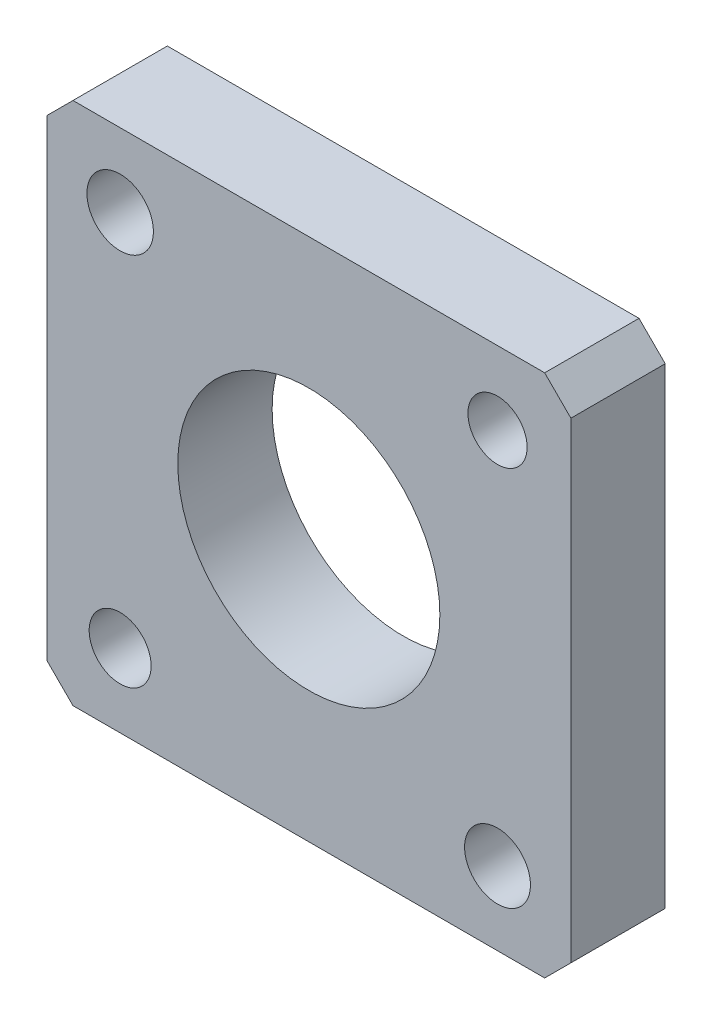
ISO-10303-21;
HEADER;
FILE_DESCRIPTION(('STEP AP214'),'2;1');
FILE_NAME('part.step','',(''),(''),'','','');
FILE_SCHEMA(('AUTOMOTIVE_DESIGN { 1 0 10303 214 1 1 1 1 }'));
ENDSEC;
DATA;
#1=APPLICATION_CONTEXT('core data for automotive mechanical design processes');
#2=APPLICATION_PROTOCOL_DEFINITION('international standard','automotive_design',2000,#1);
#3=PRODUCT_CONTEXT('',#1,'mechanical');
#4=PRODUCT('Part','Part','',(#3));
#5=PRODUCT_RELATED_PRODUCT_CATEGORY('part','',(#4));
#6=PRODUCT_DEFINITION_FORMATION('','',#4);
#7=PRODUCT_DEFINITION_CONTEXT('part definition',#1,'design');
#8=PRODUCT_DEFINITION('design','',#6,#7);
#9=PRODUCT_DEFINITION_SHAPE('','',#8);
#10=(LENGTH_UNIT() NAMED_UNIT(*) SI_UNIT(.MILLI.,.METRE.));
#11=(NAMED_UNIT(*) PLANE_ANGLE_UNIT() SI_UNIT($,.RADIAN.));
#12=(NAMED_UNIT(*) SI_UNIT($,.STERADIAN.) SOLID_ANGLE_UNIT());
#13=UNCERTAINTY_MEASURE_WITH_UNIT(LENGTH_MEASURE(1.E-05),#10,'distance_accuracy_value','');
#14=(GEOMETRIC_REPRESENTATION_CONTEXT(3) GLOBAL_UNCERTAINTY_ASSIGNED_CONTEXT((#13)) GLOBAL_UNIT_ASSIGNED_CONTEXT((#10,
#11,#12)) REPRESENTATION_CONTEXT('',''));
#15=CARTESIAN_POINT('',(0.,0.,0.));
#16=DIRECTION('',(0.,0.,1.));
#17=DIRECTION('',(1.,0.,0.));
#18=AXIS2_PLACEMENT_3D('',#15,#16,#17);
#19=CARTESIAN_POINT('',(-90.1207756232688,73.2624653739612,18.));
#20=DIRECTION('',(1.,0.,0.));
#21=DIRECTION('',(0.,1.,0.));
#22=AXIS2_PLACEMENT_3D('',#19,#20,#21);
#23=PLANE('',#22);
#24=DIRECTION('',(0.,-1.,0.));
#25=VECTOR('',#24,1.);
#26=CARTESIAN_POINT('',(-90.1207756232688,73.2624653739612,18.));
#27=LINE('',#26,#25);
#28=CARTESIAN_POINT('',(-90.1207756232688,68.2624653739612,18.));
#29=VERTEX_POINT('',#28);
#30=CARTESIAN_POINT('',(-90.1207756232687,-21.7375346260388,17.9999999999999));
#31=VERTEX_POINT('',#30);
#32=EDGE_CURVE('E120',#29,#31,#27,.T.);
#33=ORIENTED_EDGE('',*,*,#32,.F.);
#34=DIRECTION('',(0.,0.,-1.));
#35=VECTOR('',#34,1.);
#36=CARTESIAN_POINT('',(-90.1207756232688,68.2624653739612,18.));
#37=LINE('',#36,#35);
#38=CARTESIAN_POINT('',(-90.1207756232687,68.2624653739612,0.));
#39=VERTEX_POINT('',#38);
#40=EDGE_CURVE('E105',#29,#39,#37,.T.);
#41=ORIENTED_EDGE('',*,*,#40,.T.);
#42=DIRECTION('',(0.,-1.,0.));
#43=VECTOR('',#42,1.);
#44=CARTESIAN_POINT('',(-90.1207756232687,73.2624653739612,0.));
#45=LINE('',#44,#43);
#46=CARTESIAN_POINT('',(-90.1207756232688,-21.7375346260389,0.));
#47=VERTEX_POINT('',#46);
#48=EDGE_CURVE('E117',#39,#47,#45,.T.);
#49=ORIENTED_EDGE('',*,*,#48,.T.);
#50=DIRECTION('',(0.,0.,1.));
#51=VECTOR('',#50,1.);
#52=CARTESIAN_POINT('',(-90.1207756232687,-21.7375346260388,17.9999999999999));
#53=LINE('',#52,#51);
#54=EDGE_CURVE('E122',#47,#31,#53,.T.);
#55=ORIENTED_EDGE('',*,*,#54,.T.);
#56=EDGE_LOOP('',(#33,#41,#49,#55));
#57=FACE_BOUND('',#56,.T.);
#58=ADVANCED_FACE('F36',(#57),#23,.F.);
#59=CARTESIAN_POINT('',(-90.1207756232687,-26.7375346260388,17.9999999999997));
#60=DIRECTION('',(0.,1.,0.));
#61=DIRECTION('',(0.,0.,1.));
#62=AXIS2_PLACEMENT_3D('',#59,#60,#61);
#63=PLANE('',#62);
#64=DIRECTION('',(1.,0.,0.));
#65=VECTOR('',#64,1.);
#66=CARTESIAN_POINT('',(-90.1207756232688,-26.737534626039,-3.33066907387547E-13));
#67=LINE('',#66,#65);
#68=CARTESIAN_POINT('',(-85.1207756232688,-26.7375346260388,-1.11022302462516E-13));
#69=VERTEX_POINT('',#68);
#70=CARTESIAN_POINT('',(4.87922437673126,-26.7375346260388,-3.33066907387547E-13));
#71=VERTEX_POINT('',#70);
#72=EDGE_CURVE('E126',#69,#71,#67,.T.);
#73=ORIENTED_EDGE('',*,*,#72,.T.);
#74=DIRECTION('',(0.,0.,1.));
#75=VECTOR('',#74,1.);
#76=CARTESIAN_POINT('',(4.87922437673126,-26.7375346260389,17.9999999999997));
#77=LINE('',#76,#75);
#78=CARTESIAN_POINT('',(4.87922437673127,-26.7375346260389,17.9999999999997));
#79=VERTEX_POINT('',#78);
#80=EDGE_CURVE('E13',#71,#79,#77,.T.);
#81=ORIENTED_EDGE('',*,*,#80,.T.);
#82=DIRECTION('',(1.,0.,0.));
#83=VECTOR('',#82,1.);
#84=CARTESIAN_POINT('',(-90.1207756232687,-26.7375346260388,17.9999999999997));
#85=LINE('',#84,#83);
#86=CARTESIAN_POINT('',(-85.1207756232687,-26.7375346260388,17.9999999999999));
#87=VERTEX_POINT('',#86);
#88=EDGE_CURVE('E141',#87,#79,#85,.T.);
#89=ORIENTED_EDGE('',*,*,#88,.F.);
#90=DIRECTION('',(0.,0.,-1.));
#91=VECTOR('',#90,1.);
#92=CARTESIAN_POINT('',(-85.1207756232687,-26.7375346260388,17.9999999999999));
#93=LINE('',#92,#91);
#94=EDGE_CURVE('E43',#87,#69,#93,.T.);
#95=ORIENTED_EDGE('',*,*,#94,.T.);
#96=EDGE_LOOP('',(#73,#81,#89,#95));
#97=FACE_BOUND('',#96,.T.);
#98=ADVANCED_FACE('F170',(#97),#63,.F.);
#99=CARTESIAN_POINT('',(9.87922437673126,73.2624653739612,17.9999999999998));
#100=DIRECTION('',(-1.,0.,0.));
#101=DIRECTION('',(0.,-1.,0.));
#102=AXIS2_PLACEMENT_3D('',#99,#100,#101);
#103=PLANE('',#102);
#104=DIRECTION('',(0.,1.,0.));
#105=VECTOR('',#104,1.);
#106=CARTESIAN_POINT('',(9.87922437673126,73.2624653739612,-2.22044604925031E-13));
#107=LINE('',#106,#105);
#108=CARTESIAN_POINT('',(9.87922437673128,-21.7375346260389,0.));
#109=VERTEX_POINT('',#108);
#110=CARTESIAN_POINT('',(9.87922437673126,68.2624653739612,0.));
#111=VERTEX_POINT('',#110);
#112=EDGE_CURVE('E130',#109,#111,#107,.T.);
#113=ORIENTED_EDGE('',*,*,#112,.T.);
#114=DIRECTION('',(0.,0.,1.));
#115=VECTOR('',#114,1.);
#116=CARTESIAN_POINT('',(9.87922437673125,68.2624653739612,18.));
#117=LINE('',#116,#115);
#118=CARTESIAN_POINT('',(9.87922437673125,68.2624653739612,18.));
#119=VERTEX_POINT('',#118);
#120=EDGE_CURVE('E50',#111,#119,#117,.T.);
#121=ORIENTED_EDGE('',*,*,#120,.T.);
#122=DIRECTION('',(0.,1.,0.));
#123=VECTOR('',#122,1.);
#124=CARTESIAN_POINT('',(9.87922437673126,73.2624653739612,17.9999999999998));
#125=LINE('',#124,#123);
#126=CARTESIAN_POINT('',(9.87922437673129,-21.7375346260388,18.));
#127=VERTEX_POINT('',#126);
#128=EDGE_CURVE('E143',#127,#119,#125,.T.);
#129=ORIENTED_EDGE('',*,*,#128,.F.);
#130=DIRECTION('',(0.,0.,-1.));
#131=VECTOR('',#130,1.);
#132=CARTESIAN_POINT('',(9.87922437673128,-21.7375346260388,18.));
#133=LINE('',#132,#131);
#134=EDGE_CURVE('E163',#127,#109,#133,.T.);
#135=ORIENTED_EDGE('',*,*,#134,.T.);
#136=EDGE_LOOP('',(#113,#121,#129,#135));
#137=FACE_BOUND('',#136,.T.);
#138=ADVANCED_FACE('F178',(#137),#103,.F.);
#139=CARTESIAN_POINT('',(-90.1207756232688,73.2624653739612,18.));
#140=DIRECTION('',(0.,-1.,0.));
#141=DIRECTION('',(0.,0.,-1.));
#142=AXIS2_PLACEMENT_3D('',#139,#140,#141);
#143=PLANE('',#142);
#144=DIRECTION('',(-1.,0.,0.));
#145=VECTOR('',#144,1.);
#146=CARTESIAN_POINT('',(-90.1207756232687,73.2624653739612,0.));
#147=LINE('',#146,#145);
#148=CARTESIAN_POINT('',(4.87922437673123,73.2624653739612,0.));
#149=VERTEX_POINT('',#148);
#150=CARTESIAN_POINT('',(-85.1207756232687,73.2624653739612,-3.33066907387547E-13));
#151=VERTEX_POINT('',#150);
#152=EDGE_CURVE('E138',#149,#151,#147,.T.);
#153=ORIENTED_EDGE('',*,*,#152,.T.);
#154=DIRECTION('',(0.,0.,1.));
#155=VECTOR('',#154,1.);
#156=CARTESIAN_POINT('',(-85.1207756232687,73.2624653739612,17.9999999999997));
#157=LINE('',#156,#155);
#158=CARTESIAN_POINT('',(-85.1207756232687,73.2624653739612,17.9999999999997));
#159=VERTEX_POINT('',#158);
#160=EDGE_CURVE('E106',#151,#159,#157,.T.);
#161=ORIENTED_EDGE('',*,*,#160,.T.);
#162=DIRECTION('',(-1.,0.,0.));
#163=VECTOR('',#162,1.);
#164=CARTESIAN_POINT('',(-90.1207756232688,73.2624653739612,18.));
#165=LINE('',#164,#163);
#166=CARTESIAN_POINT('',(4.87922437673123,73.2624653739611,18.));
#167=VERTEX_POINT('',#166);
#168=EDGE_CURVE('E145',#167,#159,#165,.T.);
#169=ORIENTED_EDGE('',*,*,#168,.F.);
#170=DIRECTION('',(0.,0.,-1.));
#171=VECTOR('',#170,1.);
#172=CARTESIAN_POINT('',(4.87922437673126,73.2624653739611,18.));
#173=LINE('',#172,#171);
#174=EDGE_CURVE('E111',#167,#149,#173,.T.);
#175=ORIENTED_EDGE('',*,*,#174,.T.);
#176=EDGE_LOOP('',(#153,#161,#169,#175));
#177=FACE_BOUND('',#176,.T.);
#178=ADVANCED_FACE('F186',(#177),#143,.F.);
#179=CARTESIAN_POINT('',(-90.1207756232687,-26.7375346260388,17.9999999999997));
#180=DIRECTION('',(0.,0.,1.));
#181=DIRECTION('',(1.,0.,0.));
#182=AXIS2_PLACEMENT_3D('',#179,#180,#181);
#183=PLANE('',#182);
#184=CARTESIAN_POINT('',(-4.12077562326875,-12.7375346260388,18.));
#185=DIRECTION('',(0.,0.,1.));
#186=DIRECTION('',(1.,0.,0.));
#187=AXIS2_PLACEMENT_3D('',#184,#185,#186);
#188=CIRCLE('',#187,6.2848154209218);
#189=CARTESIAN_POINT('',(2.16403979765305,-12.7375346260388,18.));
#190=VERTEX_POINT('',#189);
#191=EDGE_CURVE('E254',#190,#190,#188,.T.);
#192=ORIENTED_EDGE('',*,*,#191,.F.);
#193=EDGE_LOOP('',(#192));
#194=FACE_BOUND('',#193,.T.);
#195=CARTESIAN_POINT('',(-76.1207756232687,-12.7375346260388,18.));
#196=DIRECTION('',(0.,0.,1.));
#197=DIRECTION('',(1.,0.,0.));
#198=AXIS2_PLACEMENT_3D('',#195,#196,#197);
#199=CIRCLE('',#198,5.9095106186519);
#200=CARTESIAN_POINT('',(-70.2112650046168,-12.7375346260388,18.));
#201=VERTEX_POINT('',#200);
#202=EDGE_CURVE('E256',#201,#201,#199,.T.);
#203=ORIENTED_EDGE('',*,*,#202,.F.);
#204=EDGE_LOOP('',(#203));
#205=FACE_BOUND('',#204,.T.);
#206=CARTESIAN_POINT('',(-76.1207756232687,59.2624653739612,18.));
#207=DIRECTION('',(0.,0.,1.));
#208=DIRECTION('',(1.,0.,0.));
#209=AXIS2_PLACEMENT_3D('',#206,#207,#208);
#210=CIRCLE('',#209,6.34412869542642);
#211=CARTESIAN_POINT('',(-69.7766469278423,59.2624653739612,18.));
#212=VERTEX_POINT('',#211);
#213=EDGE_CURVE('E264',#212,#212,#210,.T.);
#214=ORIENTED_EDGE('',*,*,#213,.F.);
#215=EDGE_LOOP('',(#214));
#216=FACE_BOUND('',#215,.T.);
#217=CARTESIAN_POINT('',(-4.12077562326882,59.2624653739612,18.));
#218=DIRECTION('',(0.,0.,1.));
#219=DIRECTION('',(1.,0.,0.));
#220=AXIS2_PLACEMENT_3D('',#217,#218,#219);
#221=CIRCLE('',#220,5.64830073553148);
#222=CARTESIAN_POINT('',(1.52752511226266,59.2624653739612,18.));
#223=VERTEX_POINT('',#222);
#224=EDGE_CURVE('E270',#223,#223,#221,.T.);
#225=ORIENTED_EDGE('',*,*,#224,.F.);
#226=EDGE_LOOP('',(#225));
#227=FACE_BOUND('',#226,.T.);
#228=CARTESIAN_POINT('',(-40.1207756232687,23.2624653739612,17.9999999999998));
#229=DIRECTION('',(0.,0.,1.));
#230=DIRECTION('',(1.,0.,0.));
#231=AXIS2_PLACEMENT_3D('',#228,#229,#230);
#232=CIRCLE('',#231,25.);
#233=CARTESIAN_POINT('',(-15.1207756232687,23.2624653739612,17.9999999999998));
#234=VERTEX_POINT('',#233);
#235=EDGE_CURVE('E133',#234,#234,#232,.T.);
#236=ORIENTED_EDGE('',*,*,#235,.F.);
#237=EDGE_LOOP('',(#236));
#238=FACE_BOUND('',#237,.T.);
#239=ORIENTED_EDGE('',*,*,#168,.T.);
#240=DIRECTION('',(0.707106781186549,0.707106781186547,0.));
#241=VECTOR('',#240,1.);
#242=CARTESIAN_POINT('',(-137.620775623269,20.7624653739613,18.));
#243=LINE('',#242,#241);
#244=EDGE_CURVE('E161',#159,#29,#243,.F.);
#245=ORIENTED_EDGE('',*,*,#244,.T.);
#246=ORIENTED_EDGE('',*,*,#32,.T.);
#247=DIRECTION('',(-0.707106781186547,0.707106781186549,0.));
#248=VECTOR('',#247,1.);
#249=CARTESIAN_POINT('',(-87.6207756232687,-24.2375346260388,17.9999999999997));
#250=LINE('',#249,#248);
#251=EDGE_CURVE('E156',#31,#87,#250,.F.);
#252=ORIENTED_EDGE('',*,*,#251,.T.);
#253=ORIENTED_EDGE('',*,*,#88,.T.);
#254=DIRECTION('',(-0.707106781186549,-0.707106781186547,0.));
#255=VECTOR('',#254,1.);
#256=CARTESIAN_POINT('',(-42.6207756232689,-74.2375346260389,18.));
#257=LINE('',#256,#255);
#258=EDGE_CURVE('E57',#79,#127,#257,.F.);
#259=ORIENTED_EDGE('',*,*,#258,.T.);
#260=ORIENTED_EDGE('',*,*,#128,.T.);
#261=DIRECTION('',(0.707106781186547,-0.707106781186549,0.));
#262=VECTOR('',#261,1.);
#263=CARTESIAN_POINT('',(7.3792243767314,70.7624653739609,17.9999999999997));
#264=LINE('',#263,#262);
#265=EDGE_CURVE('E159',#119,#167,#264,.F.);
#266=ORIENTED_EDGE('',*,*,#265,.T.);
#267=EDGE_LOOP('',(#239,#245,#246,#252,#253,#259,#260,#266));
#268=FACE_BOUND('',#267,.T.);
#269=ADVANCED_FACE('F180',(#194,#205,#216,#227,#238,#268),#183,.T.);
#270=CARTESIAN_POINT('',(-90.1207756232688,-26.737534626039,-3.33066907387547E-13));
#271=DIRECTION('',(0.,0.,1.));
#272=DIRECTION('',(1.,0.,0.));
#273=AXIS2_PLACEMENT_3D('',#270,#271,#272);
#274=PLANE('',#273);
#275=CARTESIAN_POINT('',(-4.12077562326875,-12.7375346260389,0.));
#276=DIRECTION('',(0.,0.,1.));
#277=DIRECTION('',(1.,0.,0.));
#278=AXIS2_PLACEMENT_3D('',#275,#276,#277);
#279=CIRCLE('',#278,6.2848154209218);
#280=CARTESIAN_POINT('',(2.16403979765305,-12.7375346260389,0.));
#281=VERTEX_POINT('',#280);
#282=EDGE_CURVE('E251',#281,#281,#279,.T.);
#283=ORIENTED_EDGE('',*,*,#282,.T.);
#284=EDGE_LOOP('',(#283));
#285=FACE_BOUND('',#284,.T.);
#286=CARTESIAN_POINT('',(-76.1207756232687,-12.7375346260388,0.));
#287=DIRECTION('',(0.,0.,1.));
#288=DIRECTION('',(1.,0.,0.));
#289=AXIS2_PLACEMENT_3D('',#286,#287,#288);
#290=CIRCLE('',#289,5.9095106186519);
#291=CARTESIAN_POINT('',(-70.2112650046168,-12.7375346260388,0.));
#292=VERTEX_POINT('',#291);
#293=EDGE_CURVE('E261',#292,#292,#290,.T.);
#294=ORIENTED_EDGE('',*,*,#293,.T.);
#295=EDGE_LOOP('',(#294));
#296=FACE_BOUND('',#295,.T.);
#297=CARTESIAN_POINT('',(-76.1207756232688,59.2624653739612,0.));
#298=DIRECTION('',(0.,0.,1.));
#299=DIRECTION('',(1.,0.,0.));
#300=AXIS2_PLACEMENT_3D('',#297,#298,#299);
#301=CIRCLE('',#300,6.34412869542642);
#302=CARTESIAN_POINT('',(-69.7766469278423,59.2624653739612,0.));
#303=VERTEX_POINT('',#302);
#304=EDGE_CURVE('E267',#303,#303,#301,.T.);
#305=ORIENTED_EDGE('',*,*,#304,.T.);
#306=EDGE_LOOP('',(#305));
#307=FACE_BOUND('',#306,.T.);
#308=CARTESIAN_POINT('',(-4.12077562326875,59.2624653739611,0.));
#309=DIRECTION('',(0.,0.,1.));
#310=DIRECTION('',(1.,0.,0.));
#311=AXIS2_PLACEMENT_3D('',#308,#309,#310);
#312=CIRCLE('',#311,5.64830073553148);
#313=CARTESIAN_POINT('',(1.52752511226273,59.2624653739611,0.));
#314=VERTEX_POINT('',#313);
#315=EDGE_CURVE('E273',#314,#314,#312,.T.);
#316=ORIENTED_EDGE('',*,*,#315,.T.);
#317=EDGE_LOOP('',(#316));
#318=FACE_BOUND('',#317,.T.);
#319=CARTESIAN_POINT('',(-40.1207756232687,23.2624653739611,-2.22044604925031E-13));
#320=DIRECTION('',(0.,0.,1.));
#321=DIRECTION('',(1.,0.,0.));
#322=AXIS2_PLACEMENT_3D('',#319,#320,#321);
#323=CIRCLE('',#322,25.);
#324=CARTESIAN_POINT('',(-15.1207756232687,23.2624653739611,-2.22044604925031E-13));
#325=VERTEX_POINT('',#324);
#326=EDGE_CURVE('E127',#325,#325,#323,.T.);
#327=ORIENTED_EDGE('',*,*,#326,.T.);
#328=EDGE_LOOP('',(#327));
#329=FACE_BOUND('',#328,.T.);
#330=ORIENTED_EDGE('',*,*,#48,.F.);
#331=DIRECTION('',(-0.707106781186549,-0.707106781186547,0.));
#332=VECTOR('',#331,1.);
#333=CARTESIAN_POINT('',(-90.1207756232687,68.2624653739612,0.));
#334=LINE('',#333,#332);
#335=EDGE_CURVE('E101',#39,#151,#334,.F.);
#336=ORIENTED_EDGE('',*,*,#335,.T.);
#337=ORIENTED_EDGE('',*,*,#152,.F.);
#338=DIRECTION('',(-0.707106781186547,0.707106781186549,0.));
#339=VECTOR('',#338,1.);
#340=CARTESIAN_POINT('',(4.87922437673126,73.2624653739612,0.));
#341=LINE('',#340,#339);
#342=EDGE_CURVE('E112',#149,#111,#341,.F.);
#343=ORIENTED_EDGE('',*,*,#342,.T.);
#344=ORIENTED_EDGE('',*,*,#112,.F.);
#345=DIRECTION('',(0.707106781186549,0.707106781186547,0.));
#346=VECTOR('',#345,1.);
#347=CARTESIAN_POINT('',(9.87922437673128,-21.7375346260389,0.));
#348=LINE('',#347,#346);
#349=EDGE_CURVE('E150',#109,#71,#348,.F.);
#350=ORIENTED_EDGE('',*,*,#349,.T.);
#351=ORIENTED_EDGE('',*,*,#72,.F.);
#352=DIRECTION('',(0.707106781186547,-0.707106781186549,0.));
#353=VECTOR('',#352,1.);
#354=CARTESIAN_POINT('',(-85.1207756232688,-26.7375346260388,-1.11022302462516E-13));
#355=LINE('',#354,#353);
#356=EDGE_CURVE('E121',#69,#47,#355,.F.);
#357=ORIENTED_EDGE('',*,*,#356,.T.);
#358=EDGE_LOOP('',(#330,#336,#337,#343,#344,#350,#351,#357));
#359=FACE_BOUND('',#358,.T.);
#360=ADVANCED_FACE('F124',(#285,#296,#307,#318,#329,#359),#274,.F.);
#361=CARTESIAN_POINT('',(-90.1207756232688,68.2624653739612,18.));
#362=DIRECTION('',(0.707106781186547,-0.707106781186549,0.));
#363=DIRECTION('',(0.707106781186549,0.707106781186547,0.));
#364=AXIS2_PLACEMENT_3D('',#361,#362,#363);
#365=PLANE('',#364);
#366=ORIENTED_EDGE('',*,*,#244,.F.);
#367=ORIENTED_EDGE('',*,*,#160,.F.);
#368=ORIENTED_EDGE('',*,*,#335,.F.);
#369=ORIENTED_EDGE('',*,*,#40,.F.);
#370=EDGE_LOOP('',(#366,#367,#368,#369));
#371=FACE_BOUND('',#370,.T.);
#372=ADVANCED_FACE('F104',(#371),#365,.F.);
#373=CARTESIAN_POINT('',(4.87922437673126,73.2624653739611,18.));
#374=DIRECTION('',(-0.707106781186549,-0.707106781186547,0.));
#375=DIRECTION('',(0.707106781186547,-0.707106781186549,0.));
#376=AXIS2_PLACEMENT_3D('',#373,#374,#375);
#377=PLANE('',#376);
#378=ORIENTED_EDGE('',*,*,#265,.F.);
#379=ORIENTED_EDGE('',*,*,#120,.F.);
#380=ORIENTED_EDGE('',*,*,#342,.F.);
#381=ORIENTED_EDGE('',*,*,#174,.F.);
#382=EDGE_LOOP('',(#378,#379,#380,#381));
#383=FACE_BOUND('',#382,.T.);
#384=ADVANCED_FACE('F184',(#383),#377,.F.);
#385=CARTESIAN_POINT('',(9.87922437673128,-21.7375346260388,18.));
#386=DIRECTION('',(-0.707106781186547,0.707106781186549,0.));
#387=DIRECTION('',(-0.707106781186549,-0.707106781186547,0.));
#388=AXIS2_PLACEMENT_3D('',#385,#386,#387);
#389=PLANE('',#388);
#390=ORIENTED_EDGE('',*,*,#258,.F.);
#391=ORIENTED_EDGE('',*,*,#80,.F.);
#392=ORIENTED_EDGE('',*,*,#349,.F.);
#393=ORIENTED_EDGE('',*,*,#134,.F.);
#394=EDGE_LOOP('',(#390,#391,#392,#393));
#395=FACE_BOUND('',#394,.T.);
#396=ADVANCED_FACE('F177',(#395),#389,.F.);
#397=CARTESIAN_POINT('',(-85.1207756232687,-26.7375346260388,17.9999999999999));
#398=DIRECTION('',(0.707106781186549,0.707106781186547,0.));
#399=DIRECTION('',(-0.707106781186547,0.707106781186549,0.));
#400=AXIS2_PLACEMENT_3D('',#397,#398,#399);
#401=PLANE('',#400);
#402=ORIENTED_EDGE('',*,*,#251,.F.);
#403=ORIENTED_EDGE('',*,*,#54,.F.);
#404=ORIENTED_EDGE('',*,*,#356,.F.);
#405=ORIENTED_EDGE('',*,*,#94,.F.);
#406=EDGE_LOOP('',(#402,#403,#404,#405));
#407=FACE_BOUND('',#406,.T.);
#408=ADVANCED_FACE('F187',(#407),#401,.F.);
#409=CARTESIAN_POINT('',(-40.1207756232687,23.2624653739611,-2.22044604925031E-13));
#410=DIRECTION('',(0.,0.,1.));
#411=DIRECTION('',(1.,0.,0.));
#412=AXIS2_PLACEMENT_3D('',#409,#410,#411);
#413=CYLINDRICAL_SURFACE('',#412,25.);
#414=ORIENTED_EDGE('',*,*,#326,.F.);
#415=EDGE_LOOP('',(#414));
#416=FACE_BOUND('',#415,.T.);
#417=ORIENTED_EDGE('',*,*,#235,.T.);
#418=EDGE_LOOP('',(#417));
#419=FACE_BOUND('',#418,.T.);
#420=ADVANCED_FACE('F189',(#416,#419),#413,.F.);
#421=CARTESIAN_POINT('',(-4.12077562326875,59.2624653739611,0.));
#422=DIRECTION('',(0.,0.,1.));
#423=DIRECTION('',(1.,0.,0.));
#424=AXIS2_PLACEMENT_3D('',#421,#422,#423);
#425=CYLINDRICAL_SURFACE('',#424,5.64830073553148);
#426=ORIENTED_EDGE('',*,*,#315,.F.);
#427=EDGE_LOOP('',(#426));
#428=FACE_BOUND('',#427,.T.);
#429=ORIENTED_EDGE('',*,*,#224,.T.);
#430=EDGE_LOOP('',(#429));
#431=FACE_BOUND('',#430,.T.);
#432=ADVANCED_FACE('F195',(#428,#431),#425,.F.);
#433=CARTESIAN_POINT('',(-76.1207756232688,59.2624653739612,0.));
#434=DIRECTION('',(0.,0.,1.));
#435=DIRECTION('',(1.,0.,0.));
#436=AXIS2_PLACEMENT_3D('',#433,#434,#435);
#437=CYLINDRICAL_SURFACE('',#436,6.34412869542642);
#438=ORIENTED_EDGE('',*,*,#304,.F.);
#439=EDGE_LOOP('',(#438));
#440=FACE_BOUND('',#439,.T.);
#441=ORIENTED_EDGE('',*,*,#213,.T.);
#442=EDGE_LOOP('',(#441));
#443=FACE_BOUND('',#442,.T.);
#444=ADVANCED_FACE('F229',(#440,#443),#437,.F.);
#445=CARTESIAN_POINT('',(-76.1207756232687,-12.7375346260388,0.));
#446=DIRECTION('',(0.,0.,1.));
#447=DIRECTION('',(1.,0.,0.));
#448=AXIS2_PLACEMENT_3D('',#445,#446,#447);
#449=CYLINDRICAL_SURFACE('',#448,5.9095106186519);
#450=ORIENTED_EDGE('',*,*,#293,.F.);
#451=EDGE_LOOP('',(#450));
#452=FACE_BOUND('',#451,.T.);
#453=ORIENTED_EDGE('',*,*,#202,.T.);
#454=EDGE_LOOP('',(#453));
#455=FACE_BOUND('',#454,.T.);
#456=ADVANCED_FACE('F235',(#452,#455),#449,.F.);
#457=CARTESIAN_POINT('',(-4.12077562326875,-12.7375346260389,0.));
#458=DIRECTION('',(0.,0.,1.));
#459=DIRECTION('',(1.,0.,0.));
#460=AXIS2_PLACEMENT_3D('',#457,#458,#459);
#461=CYLINDRICAL_SURFACE('',#460,6.2848154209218);
#462=ORIENTED_EDGE('',*,*,#282,.F.);
#463=EDGE_LOOP('',(#462));
#464=FACE_BOUND('',#463,.T.);
#465=ORIENTED_EDGE('',*,*,#191,.T.);
#466=EDGE_LOOP('',(#465));
#467=FACE_BOUND('',#466,.T.);
#468=ADVANCED_FACE('F241',(#464,#467),#461,.F.);
#469=CLOSED_SHELL('',(#58,#98,#138,#178,#269,#360,#372,#384,#396,#408,#420,#432,#444,#456,#468));
#470=MANIFOLD_SOLID_BREP('B2',#469);
#471=ADVANCED_BREP_SHAPE_REPRESENTATION('',(#18,#470),#14);
#472=SHAPE_DEFINITION_REPRESENTATION(#9,#471);
ENDSEC;
END-ISO-10303-21;
